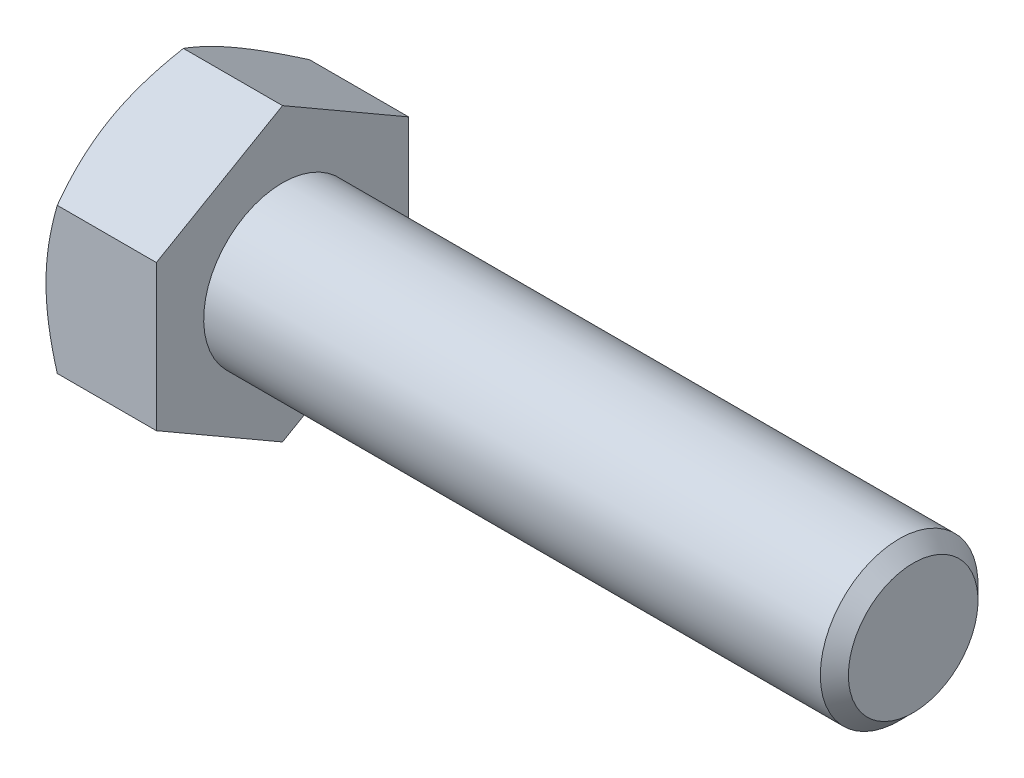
ISO-10303-21;
HEADER;
FILE_DESCRIPTION(('STEP AP214'),'2;1');
FILE_NAME('part.step','',(''),(''),'','','');
FILE_SCHEMA(('AUTOMOTIVE_DESIGN { 1 0 10303 214 1 1 1 1 }'));
ENDSEC;
DATA;
#1=APPLICATION_CONTEXT('core data for automotive mechanical design processes');
#2=APPLICATION_PROTOCOL_DEFINITION('international standard','automotive_design',2000,#1);
#3=PRODUCT_CONTEXT('',#1,'mechanical');
#4=PRODUCT('Part','Part','',(#3));
#5=PRODUCT_RELATED_PRODUCT_CATEGORY('part','',(#4));
#6=PRODUCT_DEFINITION_FORMATION('','',#4);
#7=PRODUCT_DEFINITION_CONTEXT('part definition',#1,'design');
#8=PRODUCT_DEFINITION('design','',#6,#7);
#9=PRODUCT_DEFINITION_SHAPE('','',#8);
#10=(LENGTH_UNIT() NAMED_UNIT(*) SI_UNIT(.MILLI.,.METRE.));
#11=(NAMED_UNIT(*) PLANE_ANGLE_UNIT() SI_UNIT($,.RADIAN.));
#12=(NAMED_UNIT(*) SI_UNIT($,.STERADIAN.) SOLID_ANGLE_UNIT());
#13=UNCERTAINTY_MEASURE_WITH_UNIT(LENGTH_MEASURE(1.E-05),#10,'distance_accuracy_value','');
#14=(GEOMETRIC_REPRESENTATION_CONTEXT(3) GLOBAL_UNCERTAINTY_ASSIGNED_CONTEXT((#13)) GLOBAL_UNIT_ASSIGNED_CONTEXT((#10,
#11,#12)) REPRESENTATION_CONTEXT('',''));
#15=CARTESIAN_POINT('',(0.,0.,0.));
#16=DIRECTION('',(0.,0.,1.));
#17=DIRECTION('',(1.,0.,0.));
#18=AXIS2_PLACEMENT_3D('',#15,#16,#17);
#19=CARTESIAN_POINT('',(3.5,0.,0.));
#20=DIRECTION('',(1.,0.,0.));
#21=DIRECTION('',(0.,1.,0.));
#22=AXIS2_PLACEMENT_3D('',#19,#20,#21);
#23=PLANE('',#22);
#24=CARTESIAN_POINT('',(3.5,0.,0.));
#25=DIRECTION('',(1.,0.,0.));
#26=DIRECTION('',(0.,1.,0.));
#27=AXIS2_PLACEMENT_3D('',#24,#25,#26);
#28=CIRCLE('',#27,2.5);
#29=CARTESIAN_POINT('',(3.5,2.49999999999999,0.));
#30=VERTEX_POINT('',#29);
#31=EDGE_CURVE('E11',#30,#30,#28,.T.);
#32=ORIENTED_EDGE('',*,*,#31,.F.);
#33=EDGE_LOOP('',(#32));
#34=FACE_BOUND('',#33,.T.);
#35=DIRECTION('',(0.,0.5,-0.866025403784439));
#36=VECTOR('',#35,1.);
#37=CARTESIAN_POINT('',(3.5,-4.61880215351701,0.));
#38=LINE('',#37,#36);
#39=CARTESIAN_POINT('',(3.5,-4.61880215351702,0.));
#40=VERTEX_POINT('',#39);
#41=CARTESIAN_POINT('',(3.5,-2.30940107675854,-4.));
#42=VERTEX_POINT('',#41);
#43=EDGE_CURVE('E88',#40,#42,#38,.T.);
#44=ORIENTED_EDGE('',*,*,#43,.T.);
#45=DIRECTION('',(0.,1.,0.));
#46=VECTOR('',#45,1.);
#47=CARTESIAN_POINT('',(3.5,4.61880215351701,-4.));
#48=LINE('',#47,#46);
#49=CARTESIAN_POINT('',(3.5,2.30940107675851,-4.));
#50=VERTEX_POINT('',#49);
#51=EDGE_CURVE('E99',#42,#50,#48,.T.);
#52=ORIENTED_EDGE('',*,*,#51,.T.);
#53=DIRECTION('',(0.,0.5,0.866025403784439));
#54=VECTOR('',#53,1.);
#55=CARTESIAN_POINT('',(3.5,2.30940107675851,-4.));
#56=LINE('',#55,#54);
#57=CARTESIAN_POINT('',(3.5,4.61880215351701,0.));
#58=VERTEX_POINT('',#57);
#59=EDGE_CURVE('E120',#50,#58,#56,.T.);
#60=ORIENTED_EDGE('',*,*,#59,.T.);
#61=DIRECTION('',(0.,-0.5,0.866025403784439));
#62=VECTOR('',#61,1.);
#63=CARTESIAN_POINT('',(3.5,4.61880215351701,0.));
#64=LINE('',#63,#62);
#65=CARTESIAN_POINT('',(3.5,2.30940107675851,4.));
#66=VERTEX_POINT('',#65);
#67=EDGE_CURVE('E123',#58,#66,#64,.T.);
#68=ORIENTED_EDGE('',*,*,#67,.T.);
#69=DIRECTION('',(0.,1.,0.));
#70=VECTOR('',#69,1.);
#71=CARTESIAN_POINT('',(3.5,4.61880215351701,4.));
#72=LINE('',#71,#70);
#73=CARTESIAN_POINT('',(3.5,-2.30940107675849,4.));
#74=VERTEX_POINT('',#73);
#75=EDGE_CURVE('E111',#66,#74,#72,.F.);
#76=ORIENTED_EDGE('',*,*,#75,.T.);
#77=DIRECTION('',(0.,-0.5,-0.866025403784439));
#78=VECTOR('',#77,1.);
#79=CARTESIAN_POINT('',(3.5,-2.30940107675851,4.));
#80=LINE('',#79,#78);
#81=EDGE_CURVE('E109',#74,#40,#80,.T.);
#82=ORIENTED_EDGE('',*,*,#81,.T.);
#83=EDGE_LOOP('',(#44,#52,#60,#68,#76,#82));
#84=FACE_BOUND('',#83,.T.);
#85=ADVANCED_FACE('F16',(#34,#84),#23,.T.);
#86=CARTESIAN_POINT('',(0.,4.61880215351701,0.));
#87=DIRECTION('',(1.,0.,0.));
#88=DIRECTION('',(0.,0.,-1.));
#89=AXIS2_PLACEMENT_3D('',#86,#87,#88);
#90=PLANE('',#89);
#91=CARTESIAN_POINT('',(0.,0.,0.));
#92=DIRECTION('',(1.,0.,0.));
#93=DIRECTION('',(0.,0.,-1.));
#94=AXIS2_PLACEMENT_3D('',#91,#92,#93);
#95=CIRCLE('',#94,4.0000000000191);
#96=CARTESIAN_POINT('',(-5.51642065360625E-12,-3.46410161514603,-2.00000000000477));
#97=VERTEX_POINT('',#96);
#98=CARTESIAN_POINT('',(-5.51381856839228E-12,0.,-4.00000000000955));
#99=VERTEX_POINT('',#98);
#100=EDGE_CURVE('E331',#97,#99,#95,.T.);
#101=ORIENTED_EDGE('',*,*,#100,.F.);
#102=CARTESIAN_POINT('',(0.,0.,0.));
#103=DIRECTION('',(1.,0.,0.));
#104=DIRECTION('',(0.,0.,-1.));
#105=AXIS2_PLACEMENT_3D('',#102,#103,#104);
#106=CIRCLE('',#105,4.0000000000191);
#107=CARTESIAN_POINT('',(-5.51555329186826E-12,-3.46410161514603,2.00000000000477));
#108=VERTEX_POINT('',#107);
#109=EDGE_CURVE('E327',#108,#97,#106,.T.);
#110=ORIENTED_EDGE('',*,*,#109,.F.);
#111=CARTESIAN_POINT('',(0.,0.,0.));
#112=DIRECTION('',(1.,0.,0.));
#113=DIRECTION('',(0.,0.,-1.));
#114=AXIS2_PLACEMENT_3D('',#111,#112,#113);
#115=CIRCLE('',#114,4.0000000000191);
#116=CARTESIAN_POINT('',(-5.51381856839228E-12,0.,4.00000000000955));
#117=VERTEX_POINT('',#116);
#118=EDGE_CURVE('E326',#117,#108,#115,.T.);
#119=ORIENTED_EDGE('',*,*,#118,.F.);
#120=CARTESIAN_POINT('',(0.,0.,0.));
#121=DIRECTION('',(1.,0.,0.));
#122=DIRECTION('',(0.,0.,-1.));
#123=AXIS2_PLACEMENT_3D('',#120,#121,#122);
#124=CIRCLE('',#123,4.0000000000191);
#125=CARTESIAN_POINT('',(-5.51034912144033E-12,3.46410161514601,2.00000000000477));
#126=VERTEX_POINT('',#125);
#127=EDGE_CURVE('E283',#126,#117,#124,.T.);
#128=ORIENTED_EDGE('',*,*,#127,.F.);
#129=CARTESIAN_POINT('',(0.,0.,0.));
#130=DIRECTION('',(1.,0.,0.));
#131=DIRECTION('',(0.,0.,-1.));
#132=AXIS2_PLACEMENT_3D('',#129,#130,#131);
#133=CIRCLE('',#132,4.0000000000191);
#134=CARTESIAN_POINT('',(-5.51034912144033E-12,3.46410161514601,-2.00000000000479));
#135=VERTEX_POINT('',#134);
#136=EDGE_CURVE('E25',#135,#126,#133,.T.);
#137=ORIENTED_EDGE('',*,*,#136,.F.);
#138=CARTESIAN_POINT('',(0.,0.,0.));
#139=DIRECTION('',(1.,0.,0.));
#140=DIRECTION('',(0.,0.,-1.));
#141=AXIS2_PLACEMENT_3D('',#138,#139,#140);
#142=CIRCLE('',#141,4.0000000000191);
#143=EDGE_CURVE('E333',#99,#135,#142,.T.);
#144=ORIENTED_EDGE('',*,*,#143,.F.);
#145=EDGE_LOOP('',(#101,#110,#119,#128,#137,#144));
#146=FACE_BOUND('',#145,.T.);
#147=ADVANCED_FACE('F336',(#146),#90,.F.);
#148=CARTESIAN_POINT('',(0.359409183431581,0.,0.));
#149=DIRECTION('',(1.,0.,0.));
#150=DIRECTION('',(0.,0.,-1.));
#151=AXIS2_PLACEMENT_3D('',#148,#149,#150);
#152=CONICAL_SURFACE('',#151,4.62251496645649,1.04719755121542);
#153=CARTESIAN_POINT('',(0.35726558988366,4.61880215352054,6.12466393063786E-12));
#154=CARTESIAN_POINT('',(0.302985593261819,4.52481002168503,-0.162799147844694));
#155=CARTESIAN_POINT('',(0.253255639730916,4.43006516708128,-0.326902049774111));
#156=CARTESIAN_POINT('',(0.165557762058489,4.23974029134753,-0.656554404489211));
#157=CARTESIAN_POINT('',(0.127531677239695,4.14416690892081,-0.822092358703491));
#158=CARTESIAN_POINT('',(0.0808421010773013,3.99990485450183,-1.07196156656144));
#159=CARTESIAN_POINT('',(0.0669981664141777,3.951635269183,-1.15556694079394));
#160=CARTESIAN_POINT('',(0.0430340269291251,3.85486501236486,-1.32317794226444));
#161=CARTESIAN_POINT('',(0.0329137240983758,3.8063643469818,-1.4071835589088));
#162=CARTESIAN_POINT('',(0.0165746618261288,3.7089525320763,-1.57590577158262));
#163=CARTESIAN_POINT('',(0.010375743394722,3.66004054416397,-1.66062381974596));
#164=CARTESIAN_POINT('',(0.00207983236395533,3.56212037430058,-1.83022652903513));
#165=CARTESIAN_POINT('',(-1.63478619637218E-05,3.51311217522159,-1.91511121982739));
#166=CARTESIAN_POINT('',(-1.10206982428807E-11,3.46410161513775,-2.));
#167=B_SPLINE_CURVE_WITH_KNOTS('',3,(#153,#154,#155,#156,#157,#158,#159,#160,#161,#162,#163,
#164,#165,#166),.UNSPECIFIED.,.F.,.F.,(4,2,2,2,2,2,4),(0.,0.587229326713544,1.17149154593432,
1.4640059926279,1.75651273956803,2.05048788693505,2.34452123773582),.UNSPECIFIED.);
#168=CARTESIAN_POINT('',(0.35726558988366,4.61880215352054,0.));
#169=VERTEX_POINT('',#168);
#170=EDGE_CURVE('E292',#169,#135,#167,.T.);
#171=ORIENTED_EDGE('',*,*,#170,.T.);
#172=ORIENTED_EDGE('',*,*,#136,.T.);
#173=CARTESIAN_POINT('',(-1.10206982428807E-11,3.46410161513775,2.));
#174=CARTESIAN_POINT('',(-1.63478619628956E-05,3.51311217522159,1.91511121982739));
#175=CARTESIAN_POINT('',(0.00207983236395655,3.56212037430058,1.83022652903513));
#176=CARTESIAN_POINT('',(0.0103757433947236,3.66004054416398,1.66062381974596));
#177=CARTESIAN_POINT('',(0.0165746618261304,3.7089525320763,1.57590577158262));
#178=CARTESIAN_POINT('',(0.0329137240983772,3.8063643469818,1.4071835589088));
#179=CARTESIAN_POINT('',(0.0430340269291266,3.85486501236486,1.32317794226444));
#180=CARTESIAN_POINT('',(0.0669981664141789,3.951635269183,1.15556694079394));
#181=CARTESIAN_POINT('',(0.0808421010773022,3.99990485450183,1.07196156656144));
#182=CARTESIAN_POINT('',(0.127531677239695,4.14416690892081,0.822092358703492));
#183=CARTESIAN_POINT('',(0.16555776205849,4.23974029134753,0.656554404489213));
#184=CARTESIAN_POINT('',(0.253255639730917,4.43006516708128,0.326902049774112));
#185=CARTESIAN_POINT('',(0.302985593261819,4.52481002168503,0.162799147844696));
#186=CARTESIAN_POINT('',(0.357265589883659,4.61880215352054,-6.12348741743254E-12));
#187=B_SPLINE_CURVE_WITH_KNOTS('',3,(#173,#174,#175,#176,#177,#178,#179,#180,#181,#182,#183,
#184,#185,#186),.UNSPECIFIED.,.F.,.F.,(4,2,2,2,2,2,4),(0.,0.294033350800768,0.588008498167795,
0.880515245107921,1.1730296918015,1.75729191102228,2.34452123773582),.UNSPECIFIED.);
#188=EDGE_CURVE('E128',#126,#169,#187,.T.);
#189=ORIENTED_EDGE('',*,*,#188,.T.);
#190=EDGE_LOOP('',(#171,#172,#189));
#191=FACE_BOUND('',#190,.T.);
#192=ADVANCED_FACE('F263',(#191),#152,.T.);
#193=CARTESIAN_POINT('',(0.359409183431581,0.,0.));
#194=DIRECTION('',(1.,0.,0.));
#195=DIRECTION('',(0.,0.,-1.));
#196=AXIS2_PLACEMENT_3D('',#193,#194,#195);
#197=CONICAL_SURFACE('',#196,4.62251496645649,1.04719755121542);
#198=CARTESIAN_POINT('',(0.357265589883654,2.30940107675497,4.00000000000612));
#199=CARTESIAN_POINT('',(0.302985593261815,2.40339320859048,3.83720085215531));
#200=CARTESIAN_POINT('',(0.253255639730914,2.49813806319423,3.67309795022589));
#201=CARTESIAN_POINT('',(0.165557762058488,2.68846293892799,3.34344559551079));
#202=CARTESIAN_POINT('',(0.127531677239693,2.7840363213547,3.17790764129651));
#203=CARTESIAN_POINT('',(0.0808421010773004,2.92829837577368,2.92803843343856));
#204=CARTESIAN_POINT('',(0.0669981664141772,2.97656796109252,2.84443305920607));
#205=CARTESIAN_POINT('',(0.0430340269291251,3.07333821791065,2.67682205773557));
#206=CARTESIAN_POINT('',(0.032913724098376,3.12183888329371,2.59281644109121));
#207=CARTESIAN_POINT('',(0.0165746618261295,3.21925069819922,2.42409422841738));
#208=CARTESIAN_POINT('',(0.0103757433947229,3.26816268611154,2.33937618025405));
#209=CARTESIAN_POINT('',(0.00207983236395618,3.36608285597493,2.16977347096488));
#210=CARTESIAN_POINT('',(-1.63478619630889E-05,3.41509105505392,2.08488878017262));
#211=CARTESIAN_POINT('',(-1.10206982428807E-11,3.46410161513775,2.));
#212=B_SPLINE_CURVE_WITH_KNOTS('',3,(#198,#199,#200,#201,#202,#203,#204,#205,#206,#207,#208,
#209,#210,#211),.UNSPECIFIED.,.F.,.F.,(4,2,2,2,2,2,4),(0.,0.587229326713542,1.17149154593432,
1.46400599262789,1.75651273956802,2.05048788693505,2.34452123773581),.UNSPECIFIED.);
#213=CARTESIAN_POINT('',(0.357265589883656,2.30940107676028,4.00000000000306));
#214=VERTEX_POINT('',#213);
#215=EDGE_CURVE('E129',#214,#126,#212,.T.);
#216=ORIENTED_EDGE('',*,*,#215,.T.);
#217=ORIENTED_EDGE('',*,*,#127,.T.);
#218=CARTESIAN_POINT('',(-1.10267697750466E-11,0.,4.));
#219=CARTESIAN_POINT('',(-1.63478619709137E-05,0.0980211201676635,4.));
#220=CARTESIAN_POINT('',(0.00207983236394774,0.196037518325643,4.));
#221=CARTESIAN_POINT('',(0.0103757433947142,0.391877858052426,4.));
#222=CARTESIAN_POINT('',(0.0165746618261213,0.489701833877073,4.));
#223=CARTESIAN_POINT('',(0.0329137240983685,0.684525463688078,4.));
#224=CARTESIAN_POINT('',(0.0430340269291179,0.781526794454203,4.));
#225=CARTESIAN_POINT('',(0.0669981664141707,0.975067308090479,4.));
#226=CARTESIAN_POINT('',(0.0808421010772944,1.07160647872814,4.));
#227=CARTESIAN_POINT('',(0.127531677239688,1.36013058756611,4.));
#228=CARTESIAN_POINT('',(0.165557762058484,1.55127735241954,4.));
#229=CARTESIAN_POINT('',(0.253255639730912,1.93192710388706,4.));
#230=CARTESIAN_POINT('',(0.302985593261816,2.12141681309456,4.));
#231=CARTESIAN_POINT('',(0.357265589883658,2.30940107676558,4.));
#232=B_SPLINE_CURVE_WITH_KNOTS('',3,(#218,#219,#220,#221,#222,#223,#224,#225,#226,#227,#228,
#229,#230,#231),.UNSPECIFIED.,.F.,.F.,(4,2,2,2,2,2,4),(0.,0.294033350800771,0.5880084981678,
0.880515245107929,1.17302969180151,1.75729191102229,2.34452123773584),.UNSPECIFIED.);
#233=EDGE_CURVE('E134',#117,#214,#232,.T.);
#234=ORIENTED_EDGE('',*,*,#233,.T.);
#235=EDGE_LOOP('',(#216,#217,#234));
#236=FACE_BOUND('',#235,.T.);
#237=ADVANCED_FACE('F257',(#236),#197,.T.);
#238=CARTESIAN_POINT('',(0.359409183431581,0.,0.));
#239=DIRECTION('',(1.,0.,0.));
#240=DIRECTION('',(0.,0.,-1.));
#241=AXIS2_PLACEMENT_3D('',#238,#239,#240);
#242=CONICAL_SURFACE('',#241,4.62251496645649,1.04719755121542);
#243=ORIENTED_EDGE('',*,*,#118,.T.);
#244=CARTESIAN_POINT('',(-1.10319739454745E-11,-3.46410161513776,2.));
#245=CARTESIAN_POINT('',(-1.63478619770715E-05,-3.41509105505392,2.08488878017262));
#246=CARTESIAN_POINT('',(0.00207983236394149,-3.36608285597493,2.16977347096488));
#247=CARTESIAN_POINT('',(0.0103757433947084,-3.26816268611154,2.33937618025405));
#248=CARTESIAN_POINT('',(0.016574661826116,-3.21925069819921,2.42409422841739));
#249=CARTESIAN_POINT('',(0.0329137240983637,-3.12183888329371,2.59281644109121));
#250=CARTESIAN_POINT('',(0.0430340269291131,-3.07333821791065,2.67682205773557));
#251=CARTESIAN_POINT('',(0.0669981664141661,-2.97656796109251,2.84443305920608));
#252=CARTESIAN_POINT('',(0.0808421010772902,-2.92829837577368,2.92803843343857));
#253=CARTESIAN_POINT('',(0.127531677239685,-2.78403632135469,3.17790764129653));
#254=CARTESIAN_POINT('',(0.165557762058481,-2.68846293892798,3.34344559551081));
#255=CARTESIAN_POINT('',(0.25325563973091,-2.49813806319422,3.67309795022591));
#256=CARTESIAN_POINT('',(0.302985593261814,-2.40339320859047,3.83720085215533));
#257=CARTESIAN_POINT('',(0.357265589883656,-2.30940107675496,4.00000000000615));
#258=B_SPLINE_CURVE_WITH_KNOTS('',3,(#244,#245,#246,#247,#248,#249,#250,#251,#252,#253,#254,
#255,#256,#257),.UNSPECIFIED.,.F.,.F.,(4,2,2,2,2,2,4),(0.,0.294033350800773,0.588008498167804,
0.880515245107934,1.17302969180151,1.7572919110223,2.34452123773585),.UNSPECIFIED.);
#259=CARTESIAN_POINT('',(0.35726558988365,-2.30940107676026,4.00000000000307));
#260=VERTEX_POINT('',#259);
#261=EDGE_CURVE('E140',#108,#260,#258,.T.);
#262=ORIENTED_EDGE('',*,*,#261,.T.);
#263=CARTESIAN_POINT('',(0.357265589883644,-2.30940107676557,4.));
#264=CARTESIAN_POINT('',(0.302985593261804,-2.12141681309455,4.));
#265=CARTESIAN_POINT('',(0.253255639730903,-1.93192710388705,4.));
#266=CARTESIAN_POINT('',(0.165557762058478,-1.55127735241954,4.));
#267=CARTESIAN_POINT('',(0.127531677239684,-1.36013058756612,4.));
#268=CARTESIAN_POINT('',(0.0808421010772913,-1.07160647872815,4.));
#269=CARTESIAN_POINT('',(0.0669981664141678,-0.975067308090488,4.));
#270=CARTESIAN_POINT('',(0.0430340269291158,-0.781526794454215,4.));
#271=CARTESIAN_POINT('',(0.0329137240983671,-0.684525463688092,4.));
#272=CARTESIAN_POINT('',(0.0165746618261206,-0.489701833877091,4.));
#273=CARTESIAN_POINT('',(0.0103757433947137,-0.391877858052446,4.));
#274=CARTESIAN_POINT('',(0.00207983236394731,-0.196037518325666,4.));
#275=CARTESIAN_POINT('',(-1.63478619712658E-05,-0.0980211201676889,4.));
#276=CARTESIAN_POINT('',(-1.10267697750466E-11,0.,4.));
#277=B_SPLINE_CURVE_WITH_KNOTS('',3,(#263,#264,#265,#266,#267,#268,#269,#270,#271,#272,#273,
#274,#275,#276),.UNSPECIFIED.,.F.,.F.,(4,2,2,2,2,2,4),(0.,0.587229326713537,1.17149154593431,
1.46400599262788,1.75651273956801,2.05048788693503,2.3445212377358),.UNSPECIFIED.);
#278=EDGE_CURVE('E135',#260,#117,#277,.T.);
#279=ORIENTED_EDGE('',*,*,#278,.T.);
#280=EDGE_LOOP('',(#243,#262,#279));
#281=FACE_BOUND('',#280,.T.);
#282=ADVANCED_FACE('F253',(#281),#242,.T.);
#283=CARTESIAN_POINT('',(0.359409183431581,0.,0.));
#284=DIRECTION('',(1.,0.,0.));
#285=DIRECTION('',(0.,0.,-1.));
#286=AXIS2_PLACEMENT_3D('',#283,#284,#285);
#287=CONICAL_SURFACE('',#286,4.62251496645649,1.04719755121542);
#288=ORIENTED_EDGE('',*,*,#109,.T.);
#289=CARTESIAN_POINT('',(-1.10319739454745E-11,-3.46410161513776,-2.));
#290=CARTESIAN_POINT('',(-1.6347861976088E-05,-3.5131121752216,-1.91511121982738));
#291=CARTESIAN_POINT('',(0.00207983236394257,-3.56212037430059,-1.83022652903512));
#292=CARTESIAN_POINT('',(0.0103757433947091,-3.66004054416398,-1.66062381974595));
#293=CARTESIAN_POINT('',(0.0165746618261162,-3.7089525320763,-1.57590577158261));
#294=CARTESIAN_POINT('',(0.0329137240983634,-3.80636434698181,-1.40718355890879));
#295=CARTESIAN_POINT('',(0.0430340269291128,-3.85486501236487,-1.32317794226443));
#296=CARTESIAN_POINT('',(0.0669981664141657,-3.95163526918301,-1.15556694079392));
#297=CARTESIAN_POINT('',(0.0808421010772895,-3.99990485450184,-1.07196156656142));
#298=CARTESIAN_POINT('',(0.127531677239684,-4.14416690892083,-0.822092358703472));
#299=CARTESIAN_POINT('',(0.165557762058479,-4.23974029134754,-0.656554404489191));
#300=CARTESIAN_POINT('',(0.253255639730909,-4.4300651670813,-0.326902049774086));
#301=CARTESIAN_POINT('',(0.302985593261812,-4.52481002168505,-0.162799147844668));
#302=CARTESIAN_POINT('',(0.357265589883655,-4.61880215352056,6.15223521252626E-12));
#303=B_SPLINE_CURVE_WITH_KNOTS('',3,(#289,#290,#291,#292,#293,#294,#295,#296,#297,#298,#299,
#300,#301,#302),.UNSPECIFIED.,.F.,.F.,(4,2,2,2,2,2,4),(0.,0.294033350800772,0.588008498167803,
0.880515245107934,1.17302969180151,1.7572919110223,2.34452123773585),.UNSPECIFIED.);
#304=CARTESIAN_POINT('',(0.357265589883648,-4.61880215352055,0.));
#305=VERTEX_POINT('',#304);
#306=EDGE_CURVE('E146',#97,#305,#303,.T.);
#307=ORIENTED_EDGE('',*,*,#306,.T.);
#308=CARTESIAN_POINT('',(0.35726558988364,-4.61880215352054,-6.10904840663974E-12));
#309=CARTESIAN_POINT('',(0.302985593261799,-4.52481002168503,0.162799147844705));
#310=CARTESIAN_POINT('',(0.253255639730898,-4.43006516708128,0.32690204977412));
#311=CARTESIAN_POINT('',(0.165557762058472,-4.23974029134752,0.656554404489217));
#312=CARTESIAN_POINT('',(0.127531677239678,-4.14416690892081,0.822092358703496));
#313=CARTESIAN_POINT('',(0.0808421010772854,-3.99990485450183,1.07196156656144));
#314=CARTESIAN_POINT('',(0.066998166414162,-3.951635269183,1.15556694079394));
#315=CARTESIAN_POINT('',(0.0430340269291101,-3.85486501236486,1.32317794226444));
#316=CARTESIAN_POINT('',(0.0329137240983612,-3.8063643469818,1.4071835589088));
#317=CARTESIAN_POINT('',(0.0165746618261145,-3.7089525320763,1.57590577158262));
#318=CARTESIAN_POINT('',(0.0103757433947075,-3.66004054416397,1.66062381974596));
#319=CARTESIAN_POINT('',(0.00207983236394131,-3.56212037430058,1.83022652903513));
#320=CARTESIAN_POINT('',(-1.6347861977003E-05,-3.5131121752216,1.91511121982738));
#321=CARTESIAN_POINT('',(-1.10319739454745E-11,-3.46410161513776,2.));
#322=B_SPLINE_CURVE_WITH_KNOTS('',3,(#308,#309,#310,#311,#312,#313,#314,#315,#316,#317,#318,
#319,#320,#321),.UNSPECIFIED.,.F.,.F.,(4,2,2,2,2,2,4),(0.,0.587229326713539,1.17149154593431,
1.46400599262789,1.75651273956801,2.05048788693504,2.3445212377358),.UNSPECIFIED.);
#323=EDGE_CURVE('E141',#305,#108,#322,.T.);
#324=ORIENTED_EDGE('',*,*,#323,.T.);
#325=EDGE_LOOP('',(#288,#307,#324));
#326=FACE_BOUND('',#325,.T.);
#327=ADVANCED_FACE('F180',(#326),#287,.T.);
#328=CARTESIAN_POINT('',(0.359409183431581,0.,0.));
#329=DIRECTION('',(1.,0.,0.));
#330=DIRECTION('',(0.,0.,-1.));
#331=AXIS2_PLACEMENT_3D('',#328,#329,#330);
#332=CONICAL_SURFACE('',#331,4.62251496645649,1.04719755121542);
#333=ORIENTED_EDGE('',*,*,#100,.T.);
#334=CARTESIAN_POINT('',(-1.10285044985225E-11,0.,-4.));
#335=CARTESIAN_POINT('',(-1.63478619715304E-05,-0.0980211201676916,-4.));
#336=CARTESIAN_POINT('',(0.00207983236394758,-0.196037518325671,-4.));
#337=CARTESIAN_POINT('',(0.0103757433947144,-0.391877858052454,-4.));
#338=CARTESIAN_POINT('',(0.0165746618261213,-0.489701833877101,-4.));
#339=CARTESIAN_POINT('',(0.0329137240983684,-0.684525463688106,-4.));
#340=CARTESIAN_POINT('',(0.0430340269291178,-0.781526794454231,-4.));
#341=CARTESIAN_POINT('',(0.0669981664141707,-0.975067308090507,-4.));
#342=CARTESIAN_POINT('',(0.0808421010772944,-1.07160647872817,-4.));
#343=CARTESIAN_POINT('',(0.127531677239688,-1.36013058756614,-4.));
#344=CARTESIAN_POINT('',(0.165557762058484,-1.55127735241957,-4.));
#345=CARTESIAN_POINT('',(0.253255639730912,-1.93192710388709,-4.));
#346=CARTESIAN_POINT('',(0.302985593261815,-2.12141681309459,-4.));
#347=CARTESIAN_POINT('',(0.357265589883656,-2.30940107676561,-4.));
#348=B_SPLINE_CURVE_WITH_KNOTS('',3,(#334,#335,#336,#337,#338,#339,#340,#341,#342,#343,#344,
#345,#346,#347),.UNSPECIFIED.,.F.,.F.,(4,2,2,2,2,2,4),(0.,0.294033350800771,0.588008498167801,
0.88051524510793,1.17302969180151,1.75729191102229,2.34452123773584),.UNSPECIFIED.);
#349=CARTESIAN_POINT('',(0.35726558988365,-2.3094010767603,-4.00000000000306));
#350=VERTEX_POINT('',#349);
#351=EDGE_CURVE('E95',#99,#350,#348,.T.);
#352=ORIENTED_EDGE('',*,*,#351,.T.);
#353=CARTESIAN_POINT('',(0.357265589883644,-2.30940107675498,-4.00000000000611));
#354=CARTESIAN_POINT('',(0.302985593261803,-2.40339320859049,-3.83720085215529));
#355=CARTESIAN_POINT('',(0.253255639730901,-2.49813806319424,-3.67309795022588));
#356=CARTESIAN_POINT('',(0.165557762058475,-2.68846293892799,-3.34344559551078));
#357=CARTESIAN_POINT('',(0.12753167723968,-2.78403632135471,-3.1779076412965));
#358=CARTESIAN_POINT('',(0.0808421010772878,-2.92829837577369,-2.92803843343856));
#359=CARTESIAN_POINT('',(0.0669981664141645,-2.97656796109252,-2.84443305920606));
#360=CARTESIAN_POINT('',(0.0430340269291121,-3.07333821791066,-2.67682205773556));
#361=CARTESIAN_POINT('',(0.0329137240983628,-3.12183888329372,-2.5928164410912));
#362=CARTESIAN_POINT('',(0.0165746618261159,-3.21925069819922,-2.42409422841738));
#363=CARTESIAN_POINT('',(0.0103757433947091,-3.26816268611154,-2.33937618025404));
#364=CARTESIAN_POINT('',(0.00207983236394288,-3.36608285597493,-2.16977347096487));
#365=CARTESIAN_POINT('',(-1.63478619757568E-05,-3.41509105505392,-2.08488878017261));
#366=CARTESIAN_POINT('',(-1.10319739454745E-11,-3.46410161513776,-2.));
#367=B_SPLINE_CURVE_WITH_KNOTS('',3,(#353,#354,#355,#356,#357,#358,#359,#360,#361,#362,#363,
#364,#365,#366),.UNSPECIFIED.,.F.,.F.,(4,2,2,2,2,2,4),(0.,0.587229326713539,1.17149154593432,
1.46400599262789,1.75651273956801,2.05048788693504,2.3445212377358),.UNSPECIFIED.);
#368=EDGE_CURVE('E92',#350,#97,#367,.T.);
#369=ORIENTED_EDGE('',*,*,#368,.T.);
#370=EDGE_LOOP('',(#333,#352,#369));
#371=FACE_BOUND('',#370,.T.);
#372=ADVANCED_FACE('F175',(#371),#332,.T.);
#373=CARTESIAN_POINT('',(0.359409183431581,0.,0.));
#374=DIRECTION('',(1.,0.,0.));
#375=DIRECTION('',(0.,0.,-1.));
#376=AXIS2_PLACEMENT_3D('',#373,#374,#375);
#377=CONICAL_SURFACE('',#376,4.62251496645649,1.04719755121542);
#378=CARTESIAN_POINT('',(0.357265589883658,2.30940107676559,-4.));
#379=CARTESIAN_POINT('',(0.302985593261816,2.12141681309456,-4.));
#380=CARTESIAN_POINT('',(0.253255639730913,1.93192710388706,-4.));
#381=CARTESIAN_POINT('',(0.165557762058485,1.55127735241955,-4.));
#382=CARTESIAN_POINT('',(0.127531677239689,1.36013058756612,-4.));
#383=CARTESIAN_POINT('',(0.0808421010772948,1.07160647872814,-4.));
#384=CARTESIAN_POINT('',(0.0669981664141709,0.97506730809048,-4.));
#385=CARTESIAN_POINT('',(0.0430340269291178,0.781526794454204,-4.));
#386=CARTESIAN_POINT('',(0.0329137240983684,0.684525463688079,-4.));
#387=CARTESIAN_POINT('',(0.0165746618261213,0.489701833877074,-4.));
#388=CARTESIAN_POINT('',(0.0103757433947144,0.391877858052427,-4.));
#389=CARTESIAN_POINT('',(0.00207983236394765,0.196037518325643,-4.));
#390=CARTESIAN_POINT('',(-1.63478619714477E-05,0.0980211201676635,-4.));
#391=CARTESIAN_POINT('',(-1.10285044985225E-11,0.,-4.));
#392=B_SPLINE_CURVE_WITH_KNOTS('',3,(#378,#379,#380,#381,#382,#383,#384,#385,#386,#387,#388,
#389,#390,#391),.UNSPECIFIED.,.F.,.F.,(4,2,2,2,2,2,4),(0.,0.58722932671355,1.17149154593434,
1.46400599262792,1.75651273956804,2.05048788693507,2.34452123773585),.UNSPECIFIED.);
#393=CARTESIAN_POINT('',(0.357265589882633,2.30940107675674,-4.00000000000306));
#394=VERTEX_POINT('',#393);
#395=EDGE_CURVE('E122',#394,#99,#392,.T.);
#396=ORIENTED_EDGE('',*,*,#395,.T.);
#397=ORIENTED_EDGE('',*,*,#143,.T.);
#398=CARTESIAN_POINT('',(-1.10206982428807E-11,3.46410161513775,-2.));
#399=CARTESIAN_POINT('',(-1.63478619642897E-05,3.41509105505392,-2.08488878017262));
#400=CARTESIAN_POINT('',(0.00207983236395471,3.36608285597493,-2.16977347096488));
#401=CARTESIAN_POINT('',(0.0103757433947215,3.26816268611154,-2.33937618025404));
#402=CARTESIAN_POINT('',(0.0165746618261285,3.21925069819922,-2.42409422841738));
#403=CARTESIAN_POINT('',(0.0329137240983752,3.12183888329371,-2.5928164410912));
#404=CARTESIAN_POINT('',(0.0430340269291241,3.07333821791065,-2.67682205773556));
#405=CARTESIAN_POINT('',(0.0669981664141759,2.97656796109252,-2.84443305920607));
#406=CARTESIAN_POINT('',(0.080842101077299,2.92829837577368,-2.92803843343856));
#407=CARTESIAN_POINT('',(0.127531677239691,2.7840363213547,-3.17790764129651));
#408=CARTESIAN_POINT('',(0.165557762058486,2.68846293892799,-3.34344559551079));
#409=CARTESIAN_POINT('',(0.253255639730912,2.49813806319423,-3.67309795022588));
#410=CARTESIAN_POINT('',(0.302985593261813,2.40339320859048,-3.8372008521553));
#411=CARTESIAN_POINT('',(0.357265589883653,2.30940107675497,-4.00000000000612));
#412=B_SPLINE_CURVE_WITH_KNOTS('',3,(#398,#399,#400,#401,#402,#403,#404,#405,#406,#407,#408,
#409,#410,#411),.UNSPECIFIED.,.F.,.F.,(4,2,2,2,2,2,4),(0.,0.294033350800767,0.588008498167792,
0.880515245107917,1.17302969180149,1.75729191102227,2.34452123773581),.UNSPECIFIED.);
#413=EDGE_CURVE('E193',#135,#394,#412,.T.);
#414=ORIENTED_EDGE('',*,*,#413,.T.);
#415=EDGE_LOOP('',(#396,#397,#414));
#416=FACE_BOUND('',#415,.T.);
#417=ADVANCED_FACE('F179',(#416),#377,.T.);
#418=CARTESIAN_POINT('',(3.5,2.30940107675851,-4.));
#419=DIRECTION('',(0.,-0.866025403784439,0.5));
#420=DIRECTION('',(0.,-0.5,-0.866025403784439));
#421=AXIS2_PLACEMENT_3D('',#418,#419,#420);
#422=PLANE('',#421);
#423=DIRECTION('',(1.,0.,0.));
#424=VECTOR('',#423,1.);
#425=CARTESIAN_POINT('',(3.5,4.61880215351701,0.));
#426=LINE('',#425,#424);
#427=EDGE_CURVE('E126',#169,#58,#426,.T.);
#428=ORIENTED_EDGE('',*,*,#427,.T.);
#429=ORIENTED_EDGE('',*,*,#59,.F.);
#430=DIRECTION('',(1.,0.,0.));
#431=VECTOR('',#430,1.);
#432=CARTESIAN_POINT('',(3.5,2.30940107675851,-4.));
#433=LINE('',#432,#431);
#434=EDGE_CURVE('E19',#50,#394,#433,.F.);
#435=ORIENTED_EDGE('',*,*,#434,.T.);
#436=ORIENTED_EDGE('',*,*,#413,.F.);
#437=ORIENTED_EDGE('',*,*,#170,.F.);
#438=EDGE_LOOP('',(#428,#429,#435,#436,#437));
#439=FACE_BOUND('',#438,.T.);
#440=ADVANCED_FACE('F187',(#439),#422,.F.);
#441=CARTESIAN_POINT('',(3.5,4.61880215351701,0.));
#442=DIRECTION('',(0.,-0.866025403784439,-0.5));
#443=DIRECTION('',(0.,0.5,-0.866025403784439));
#444=AXIS2_PLACEMENT_3D('',#441,#442,#443);
#445=PLANE('',#444);
#446=DIRECTION('',(-1.,0.,0.));
#447=VECTOR('',#446,1.);
#448=CARTESIAN_POINT('',(3.5,2.30940107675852,4.));
#449=LINE('',#448,#447);
#450=EDGE_CURVE('E132',#214,#66,#449,.F.);
#451=ORIENTED_EDGE('',*,*,#450,.T.);
#452=ORIENTED_EDGE('',*,*,#67,.F.);
#453=ORIENTED_EDGE('',*,*,#427,.F.);
#454=ORIENTED_EDGE('',*,*,#188,.F.);
#455=ORIENTED_EDGE('',*,*,#215,.F.);
#456=EDGE_LOOP('',(#451,#452,#453,#454,#455));
#457=FACE_BOUND('',#456,.T.);
#458=ADVANCED_FACE('F232',(#457),#445,.F.);
#459=CARTESIAN_POINT('',(3.5,2.3094010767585,4.));
#460=DIRECTION('',(0.,0.,-1.));
#461=DIRECTION('',(-1.,0.,0.));
#462=AXIS2_PLACEMENT_3D('',#459,#460,#461);
#463=PLANE('',#462);
#464=DIRECTION('',(1.,0.,0.));
#465=VECTOR('',#464,1.);
#466=CARTESIAN_POINT('',(3.5,-2.30940107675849,4.));
#467=LINE('',#466,#465);
#468=EDGE_CURVE('E138',#260,#74,#467,.T.);
#469=ORIENTED_EDGE('',*,*,#468,.T.);
#470=ORIENTED_EDGE('',*,*,#75,.F.);
#471=ORIENTED_EDGE('',*,*,#450,.F.);
#472=ORIENTED_EDGE('',*,*,#233,.F.);
#473=ORIENTED_EDGE('',*,*,#278,.F.);
#474=EDGE_LOOP('',(#469,#470,#471,#472,#473));
#475=FACE_BOUND('',#474,.T.);
#476=ADVANCED_FACE('F227',(#475),#463,.F.);
#477=CARTESIAN_POINT('',(3.5,-2.30940107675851,4.));
#478=DIRECTION('',(0.,0.866025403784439,-0.5));
#479=DIRECTION('',(0.,0.5,0.866025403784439));
#480=AXIS2_PLACEMENT_3D('',#477,#478,#479);
#481=PLANE('',#480);
#482=DIRECTION('',(1.,0.,0.));
#483=VECTOR('',#482,1.);
#484=CARTESIAN_POINT('',(3.5,-4.61880215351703,0.));
#485=LINE('',#484,#483);
#486=EDGE_CURVE('E144',#305,#40,#485,.T.);
#487=ORIENTED_EDGE('',*,*,#486,.T.);
#488=ORIENTED_EDGE('',*,*,#81,.F.);
#489=ORIENTED_EDGE('',*,*,#468,.F.);
#490=ORIENTED_EDGE('',*,*,#261,.F.);
#491=ORIENTED_EDGE('',*,*,#323,.F.);
#492=EDGE_LOOP('',(#487,#488,#489,#490,#491));
#493=FACE_BOUND('',#492,.T.);
#494=ADVANCED_FACE('F222',(#493),#481,.F.);
#495=CARTESIAN_POINT('',(3.5,-4.61880215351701,0.));
#496=DIRECTION('',(0.,0.866025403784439,0.5));
#497=DIRECTION('',(0.,-0.5,0.866025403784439));
#498=AXIS2_PLACEMENT_3D('',#495,#496,#497);
#499=PLANE('',#498);
#500=DIRECTION('',(1.,0.,0.));
#501=VECTOR('',#500,1.);
#502=CARTESIAN_POINT('',(3.5,-2.30940107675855,-4.));
#503=LINE('',#502,#501);
#504=EDGE_CURVE('E83',#350,#42,#503,.T.);
#505=ORIENTED_EDGE('',*,*,#504,.T.);
#506=ORIENTED_EDGE('',*,*,#43,.F.);
#507=ORIENTED_EDGE('',*,*,#486,.F.);
#508=ORIENTED_EDGE('',*,*,#306,.F.);
#509=ORIENTED_EDGE('',*,*,#368,.F.);
#510=EDGE_LOOP('',(#505,#506,#507,#508,#509));
#511=FACE_BOUND('',#510,.T.);
#512=ADVANCED_FACE('F85',(#511),#499,.F.);
#513=CARTESIAN_POINT('',(3.5,-2.30940107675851,-4.));
#514=DIRECTION('',(0.,0.,1.));
#515=DIRECTION('',(1.,0.,0.));
#516=AXIS2_PLACEMENT_3D('',#513,#514,#515);
#517=PLANE('',#516);
#518=ORIENTED_EDGE('',*,*,#434,.F.);
#519=ORIENTED_EDGE('',*,*,#51,.F.);
#520=ORIENTED_EDGE('',*,*,#504,.F.);
#521=ORIENTED_EDGE('',*,*,#351,.F.);
#522=ORIENTED_EDGE('',*,*,#395,.F.);
#523=EDGE_LOOP('',(#518,#519,#520,#521,#522));
#524=FACE_BOUND('',#523,.T.);
#525=ADVANCED_FACE('F100',(#524),#517,.F.);
#526=CARTESIAN_POINT('',(-3.57106781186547,0.,0.));
#527=DIRECTION('',(1.,0.,0.));
#528=DIRECTION('',(0.,1.,0.));
#529=AXIS2_PLACEMENT_3D('',#526,#527,#528);
#530=CYLINDRICAL_SURFACE('',#529,2.5);
#531=ORIENTED_EDGE('',*,*,#31,.T.);
#532=EDGE_LOOP('',(#531));
#533=FACE_BOUND('',#532,.T.);
#534=CARTESIAN_POINT('',(23.055,0.,0.));
#535=DIRECTION('',(-1.,0.,0.));
#536=DIRECTION('',(0.,0.,1.));
#537=AXIS2_PLACEMENT_3D('',#534,#535,#536);
#538=CIRCLE('',#537,2.5);
#539=CARTESIAN_POINT('',(23.055,0.,2.5));
#540=VERTEX_POINT('',#539);
#541=EDGE_CURVE('E105',#540,#540,#538,.T.);
#542=ORIENTED_EDGE('',*,*,#541,.T.);
#543=EDGE_LOOP('',(#542));
#544=FACE_BOUND('',#543,.T.);
#545=ADVANCED_FACE('F210',(#533,#544),#530,.T.);
#546=CARTESIAN_POINT('',(23.5,2.055,0.));
#547=DIRECTION('',(-1.,0.,0.));
#548=DIRECTION('',(0.,0.,1.));
#549=AXIS2_PLACEMENT_3D('',#546,#547,#548);
#550=PLANE('',#549);
#551=CARTESIAN_POINT('',(23.4999999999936,0.,0.));
#552=DIRECTION('',(-1.,0.,0.));
#553=DIRECTION('',(0.,0.,1.));
#554=AXIS2_PLACEMENT_3D('',#551,#552,#553);
#555=CIRCLE('',#554,2.05499999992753);
#556=CARTESIAN_POINT('',(23.4999999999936,0.,2.05499999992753));
#557=VERTEX_POINT('',#556);
#558=EDGE_CURVE('E358',#557,#557,#555,.T.);
#559=ORIENTED_EDGE('',*,*,#558,.F.);
#560=EDGE_LOOP('',(#559));
#561=FACE_BOUND('',#560,.T.);
#562=ADVANCED_FACE('F218',(#561),#550,.F.);
#563=CARTESIAN_POINT('',(23.0550000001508,0.,0.));
#564=DIRECTION('',(-1.,0.,0.));
#565=DIRECTION('',(0.,0.,1.));
#566=AXIS2_PLACEMENT_3D('',#563,#564,#565);
#567=CONICAL_SURFACE('',#566,2.49999999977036,0.785398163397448);
#568=ORIENTED_EDGE('',*,*,#541,.F.);
#569=EDGE_LOOP('',(#568));
#570=FACE_BOUND('',#569,.T.);
#571=ORIENTED_EDGE('',*,*,#558,.T.);
#572=EDGE_LOOP('',(#571));
#573=FACE_BOUND('',#572,.T.);
#574=ADVANCED_FACE('F221',(#570,#573),#567,.T.);
#575=CLOSED_SHELL('',(#85,#147,#192,#237,#282,#327,#372,#417,#440,#458,#476,#494,#512,#525,#545,
#562,#574));
#576=MANIFOLD_SOLID_BREP('B1',#575);
#577=ADVANCED_BREP_SHAPE_REPRESENTATION('',(#18,#576),#14);
#578=SHAPE_DEFINITION_REPRESENTATION(#9,#577);
ENDSEC;
END-ISO-10303-21;
